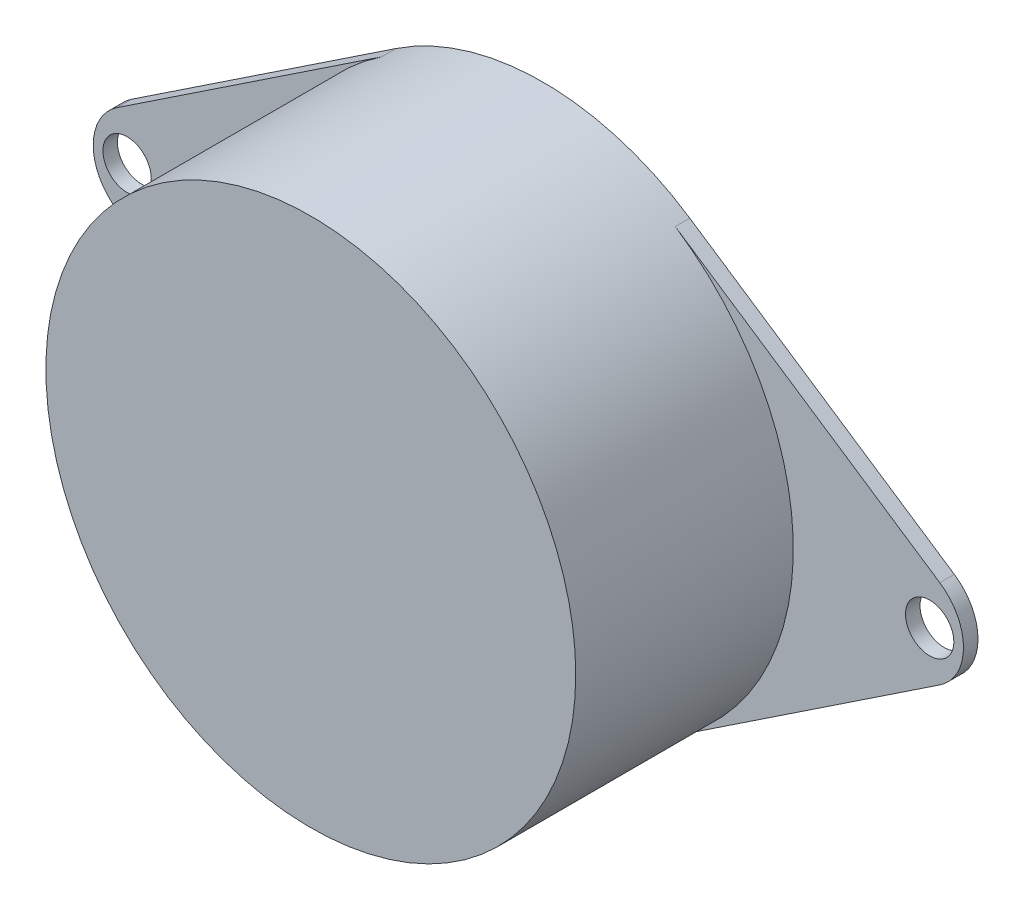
ISO-10303-21;
HEADER;
FILE_DESCRIPTION(('STEP AP214'),'2;1');
FILE_NAME('part.step','',(''),(''),'','','');
FILE_SCHEMA(('AUTOMOTIVE_DESIGN { 1 0 10303 214 1 1 1 1 }'));
ENDSEC;
DATA;
#1=APPLICATION_CONTEXT('core data for automotive mechanical design processes');
#2=APPLICATION_PROTOCOL_DEFINITION('international standard','automotive_design',2000,#1);
#3=PRODUCT_CONTEXT('',#1,'mechanical');
#4=PRODUCT('Part','Part','',(#3));
#5=PRODUCT_RELATED_PRODUCT_CATEGORY('part','',(#4));
#6=PRODUCT_DEFINITION_FORMATION('','',#4);
#7=PRODUCT_DEFINITION_CONTEXT('part definition',#1,'design');
#8=PRODUCT_DEFINITION('design','',#6,#7);
#9=PRODUCT_DEFINITION_SHAPE('','',#8);
#10=(LENGTH_UNIT() NAMED_UNIT(*) SI_UNIT(.MILLI.,.METRE.));
#11=(NAMED_UNIT(*) PLANE_ANGLE_UNIT() SI_UNIT($,.RADIAN.));
#12=(NAMED_UNIT(*) SI_UNIT($,.STERADIAN.) SOLID_ANGLE_UNIT());
#13=UNCERTAINTY_MEASURE_WITH_UNIT(LENGTH_MEASURE(1.E-05),#10,'distance_accuracy_value','');
#14=(GEOMETRIC_REPRESENTATION_CONTEXT(3) GLOBAL_UNCERTAINTY_ASSIGNED_CONTEXT((#13)) GLOBAL_UNIT_ASSIGNED_CONTEXT((#10,
#11,#12)) REPRESENTATION_CONTEXT('',''));
#15=CARTESIAN_POINT('',(0.,0.,0.));
#16=DIRECTION('',(0.,0.,1.));
#17=DIRECTION('',(1.,0.,0.));
#18=AXIS2_PLACEMENT_3D('',#15,#16,#17);
#19=CARTESIAN_POINT('',(0.,0.,0.));
#20=DIRECTION('',(0.,0.,1.));
#21=DIRECTION('',(1.,0.,0.));
#22=AXIS2_PLACEMENT_3D('',#19,#20,#21);
#23=PLANE('',#22);
#24=CARTESIAN_POINT('',(-41.5,0.,0.));
#25=DIRECTION('',(0.,0.,1.));
#26=DIRECTION('',(1.,0.,0.));
#27=AXIS2_PLACEMENT_3D('',#24,#25,#26);
#28=CIRCLE('',#27,2.5);
#29=CARTESIAN_POINT('',(-39.,0.,0.));
#30=VERTEX_POINT('',#29);
#31=EDGE_CURVE('E160',#30,#30,#28,.T.);
#32=ORIENTED_EDGE('',*,*,#31,.T.);
#33=EDGE_LOOP('',(#32));
#34=FACE_BOUND('',#33,.T.);
#35=CARTESIAN_POINT('',(41.5,0.,0.));
#36=DIRECTION('',(0.,0.,1.));
#37=DIRECTION('',(1.,0.,0.));
#38=AXIS2_PLACEMENT_3D('',#35,#36,#37);
#39=CIRCLE('',#38,2.5);
#40=CARTESIAN_POINT('',(44.,0.,0.));
#41=VERTEX_POINT('',#40);
#42=EDGE_CURVE('E156',#41,#41,#39,.T.);
#43=ORIENTED_EDGE('',*,*,#42,.T.);
#44=EDGE_LOOP('',(#43));
#45=FACE_BOUND('',#44,.T.);
#46=CARTESIAN_POINT('',(0.,0.,0.));
#47=DIRECTION('',(0.,0.,1.));
#48=DIRECTION('',(1.,0.,0.));
#49=AXIS2_PLACEMENT_3D('',#46,#47,#48);
#50=CIRCLE('',#49,27.4);
#51=CARTESIAN_POINT('',(15.1913924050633,22.8031049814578,0.));
#52=VERTEX_POINT('',#51);
#53=CARTESIAN_POINT('',(-15.1913924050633,22.8031049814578,0.));
#54=VERTEX_POINT('',#53);
#55=EDGE_CURVE('E179',#52,#54,#50,.T.);
#56=ORIENTED_EDGE('',*,*,#55,.F.);
#57=DIRECTION('',(-0.832230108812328,0.554430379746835,0.));
#58=VECTOR('',#57,1.);
#59=CARTESIAN_POINT('',(15.1913924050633,22.8031049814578,0.));
#60=LINE('',#59,#58);
#61=CARTESIAN_POINT('',(42.5493670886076,4.5772655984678,0.));
#62=VERTEX_POINT('',#61);
#63=EDGE_CURVE('E103',#62,#52,#60,.T.);
#64=ORIENTED_EDGE('',*,*,#63,.F.);
#65=CARTESIAN_POINT('',(39.5,0.,0.));
#66=DIRECTION('',(0.,0.,1.));
#67=DIRECTION('',(1.,0.,0.));
#68=AXIS2_PLACEMENT_3D('',#65,#66,#67);
#69=CIRCLE('',#68,5.5);
#70=CARTESIAN_POINT('',(42.5493670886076,-4.57726559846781,0.));
#71=VERTEX_POINT('',#70);
#72=EDGE_CURVE('E191',#71,#62,#69,.T.);
#73=ORIENTED_EDGE('',*,*,#72,.F.);
#74=DIRECTION('',(0.832230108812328,0.554430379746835,0.));
#75=VECTOR('',#74,1.);
#76=CARTESIAN_POINT('',(15.1913924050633,-22.8031049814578,0.));
#77=LINE('',#76,#75);
#78=CARTESIAN_POINT('',(15.1913924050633,-22.8031049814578,0.));
#79=VERTEX_POINT('',#78);
#80=EDGE_CURVE('E189',#79,#71,#77,.T.);
#81=ORIENTED_EDGE('',*,*,#80,.F.);
#82=CARTESIAN_POINT('',(0.,0.,0.));
#83=DIRECTION('',(0.,0.,1.));
#84=DIRECTION('',(1.,0.,0.));
#85=AXIS2_PLACEMENT_3D('',#82,#83,#84);
#86=CIRCLE('',#85,27.4);
#87=CARTESIAN_POINT('',(-15.1913924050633,-22.8031049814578,0.));
#88=VERTEX_POINT('',#87);
#89=EDGE_CURVE('E187',#88,#79,#86,.T.);
#90=ORIENTED_EDGE('',*,*,#89,.F.);
#91=DIRECTION('',(0.832230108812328,-0.554430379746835,0.));
#92=VECTOR('',#91,1.);
#93=CARTESIAN_POINT('',(-42.5493670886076,-4.57726559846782,0.));
#94=LINE('',#93,#92);
#95=CARTESIAN_POINT('',(-42.5493670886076,-4.57726559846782,0.));
#96=VERTEX_POINT('',#95);
#97=EDGE_CURVE('E185',#96,#88,#94,.T.);
#98=ORIENTED_EDGE('',*,*,#97,.F.);
#99=CARTESIAN_POINT('',(-39.5,0.,0.));
#100=DIRECTION('',(0.,0.,1.));
#101=DIRECTION('',(1.,0.,0.));
#102=AXIS2_PLACEMENT_3D('',#99,#100,#101);
#103=CIRCLE('',#102,5.5);
#104=CARTESIAN_POINT('',(-42.5493670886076,4.5772655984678,0.));
#105=VERTEX_POINT('',#104);
#106=EDGE_CURVE('E183',#105,#96,#103,.T.);
#107=ORIENTED_EDGE('',*,*,#106,.F.);
#108=DIRECTION('',(-0.832230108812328,-0.554430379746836,0.));
#109=VECTOR('',#108,1.);
#110=CARTESIAN_POINT('',(-42.5493670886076,4.57726559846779,0.));
#111=LINE('',#110,#109);
#112=EDGE_CURVE('E181',#54,#105,#111,.T.);
#113=ORIENTED_EDGE('',*,*,#112,.F.);
#114=EDGE_LOOP('',(#56,#64,#73,#81,#90,#98,#107,#113));
#115=FACE_BOUND('',#114,.T.);
#116=CARTESIAN_POINT('',(0.,0.,0.));
#117=DIRECTION('',(0.,0.,1.));
#118=DIRECTION('',(1.,0.,0.));
#119=AXIS2_PLACEMENT_3D('',#116,#117,#118);
#120=CIRCLE('',#119,5.4);
#121=CARTESIAN_POINT('',(5.4,0.,0.));
#122=VERTEX_POINT('',#121);
#123=EDGE_CURVE('E11',#122,#122,#120,.F.);
#124=ORIENTED_EDGE('',*,*,#123,.F.);
#125=EDGE_LOOP('',(#124));
#126=FACE_BOUND('',#125,.T.);
#127=ADVANCED_FACE('F33',(#34,#45,#115,#126),#23,.F.);
#128=CARTESIAN_POINT('',(0.,0.,1.5));
#129=DIRECTION('',(0.,0.,1.));
#130=DIRECTION('',(1.,0.,0.));
#131=AXIS2_PLACEMENT_3D('',#128,#129,#130);
#132=PLANE('',#131);
#133=CARTESIAN_POINT('',(-41.5,0.,1.5));
#134=DIRECTION('',(0.,0.,1.));
#135=DIRECTION('',(1.,0.,0.));
#136=AXIS2_PLACEMENT_3D('',#133,#134,#135);
#137=CIRCLE('',#136,2.5);
#138=CARTESIAN_POINT('',(-39.,0.,1.5));
#139=VERTEX_POINT('',#138);
#140=EDGE_CURVE('E162',#139,#139,#137,.T.);
#141=ORIENTED_EDGE('',*,*,#140,.F.);
#142=EDGE_LOOP('',(#141));
#143=FACE_BOUND('',#142,.T.);
#144=CARTESIAN_POINT('',(0.,0.,1.5));
#145=DIRECTION('',(0.,0.,1.));
#146=DIRECTION('',(1.,0.,0.));
#147=AXIS2_PLACEMENT_3D('',#144,#145,#146);
#148=CIRCLE('',#147,27.4);
#149=CARTESIAN_POINT('',(-15.1913924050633,22.8031049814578,1.5));
#150=VERTEX_POINT('',#149);
#151=CARTESIAN_POINT('',(-15.1913924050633,-22.8031049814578,1.5));
#152=VERTEX_POINT('',#151);
#153=EDGE_CURVE('E41',#150,#152,#148,.T.);
#154=ORIENTED_EDGE('',*,*,#153,.F.);
#155=DIRECTION('',(-0.832230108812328,-0.554430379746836,0.));
#156=VECTOR('',#155,1.);
#157=CARTESIAN_POINT('',(-42.5493670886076,4.57726559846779,1.5));
#158=LINE('',#157,#156);
#159=CARTESIAN_POINT('',(-42.5493670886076,4.5772655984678,1.5));
#160=VERTEX_POINT('',#159);
#161=EDGE_CURVE('E150',#150,#160,#158,.T.);
#162=ORIENTED_EDGE('',*,*,#161,.T.);
#163=CARTESIAN_POINT('',(-39.5,0.,1.5));
#164=DIRECTION('',(0.,0.,1.));
#165=DIRECTION('',(1.,0.,0.));
#166=AXIS2_PLACEMENT_3D('',#163,#164,#165);
#167=CIRCLE('',#166,5.5);
#168=CARTESIAN_POINT('',(-42.5493670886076,-4.57726559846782,1.5));
#169=VERTEX_POINT('',#168);
#170=EDGE_CURVE('E141',#160,#169,#167,.T.);
#171=ORIENTED_EDGE('',*,*,#170,.T.);
#172=DIRECTION('',(0.832230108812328,-0.554430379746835,0.));
#173=VECTOR('',#172,1.);
#174=CARTESIAN_POINT('',(-42.5493670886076,-4.57726559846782,1.5));
#175=LINE('',#174,#173);
#176=EDGE_CURVE('E139',#169,#152,#175,.T.);
#177=ORIENTED_EDGE('',*,*,#176,.T.);
#178=EDGE_LOOP('',(#154,#162,#171,#177));
#179=FACE_BOUND('',#178,.T.);
#180=ADVANCED_FACE('F220',(#143,#179),#132,.T.);
#181=CARTESIAN_POINT('',(-42.5493670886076,4.57726559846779,1.5));
#182=DIRECTION('',(0.554430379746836,-0.832230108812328,0.));
#183=DIRECTION('',(0.832230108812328,0.554430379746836,0.));
#184=AXIS2_PLACEMENT_3D('',#181,#182,#183);
#185=PLANE('',#184);
#186=ORIENTED_EDGE('',*,*,#112,.T.);
#187=DIRECTION('',(0.,0.,-1.));
#188=VECTOR('',#187,1.);
#189=CARTESIAN_POINT('',(-42.5493670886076,4.5772655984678,1.5));
#190=LINE('',#189,#188);
#191=EDGE_CURVE('E123',#160,#105,#190,.T.);
#192=ORIENTED_EDGE('',*,*,#191,.F.);
#193=ORIENTED_EDGE('',*,*,#161,.F.);
#194=DIRECTION('',(0.,0.,-1.));
#195=VECTOR('',#194,1.);
#196=CARTESIAN_POINT('',(-15.1913924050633,22.8031049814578,1.5));
#197=LINE('',#196,#195);
#198=EDGE_CURVE('E118',#150,#54,#197,.T.);
#199=ORIENTED_EDGE('',*,*,#198,.T.);
#200=EDGE_LOOP('',(#186,#192,#193,#199));
#201=FACE_BOUND('',#200,.T.);
#202=ADVANCED_FACE('F35',(#201),#185,.F.);
#203=CARTESIAN_POINT('',(-39.5,0.,1.5));
#204=DIRECTION('',(0.,0.,-1.));
#205=DIRECTION('',(-1.,0.,0.));
#206=AXIS2_PLACEMENT_3D('',#203,#204,#205);
#207=CYLINDRICAL_SURFACE('',#206,5.5);
#208=ORIENTED_EDGE('',*,*,#106,.T.);
#209=DIRECTION('',(0.,0.,-1.));
#210=VECTOR('',#209,1.);
#211=CARTESIAN_POINT('',(-42.5493670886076,-4.57726559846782,1.5));
#212=LINE('',#211,#210);
#213=EDGE_CURVE('E147',#169,#96,#212,.T.);
#214=ORIENTED_EDGE('',*,*,#213,.F.);
#215=ORIENTED_EDGE('',*,*,#170,.F.);
#216=ORIENTED_EDGE('',*,*,#191,.T.);
#217=EDGE_LOOP('',(#208,#214,#215,#216));
#218=FACE_BOUND('',#217,.T.);
#219=ADVANCED_FACE('F209',(#218),#207,.T.);
#220=CARTESIAN_POINT('',(-42.5493670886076,-4.57726559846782,1.5));
#221=DIRECTION('',(0.554430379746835,0.832230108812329,0.));
#222=DIRECTION('',(-0.832230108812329,0.554430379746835,0.));
#223=AXIS2_PLACEMENT_3D('',#220,#221,#222);
#224=PLANE('',#223);
#225=ORIENTED_EDGE('',*,*,#97,.T.);
#226=DIRECTION('',(0.,0.,-1.));
#227=VECTOR('',#226,1.);
#228=CARTESIAN_POINT('',(-15.1913924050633,-22.8031049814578,1.5));
#229=LINE('',#228,#227);
#230=EDGE_CURVE('E144',#152,#88,#229,.T.);
#231=ORIENTED_EDGE('',*,*,#230,.F.);
#232=ORIENTED_EDGE('',*,*,#176,.F.);
#233=ORIENTED_EDGE('',*,*,#213,.T.);
#234=EDGE_LOOP('',(#225,#231,#232,#233));
#235=FACE_BOUND('',#234,.T.);
#236=ADVANCED_FACE('F217',(#235),#224,.F.);
#237=CARTESIAN_POINT('',(0.,0.,1.5));
#238=DIRECTION('',(0.,0.,-1.));
#239=DIRECTION('',(-1.,0.,0.));
#240=AXIS2_PLACEMENT_3D('',#237,#238,#239);
#241=CYLINDRICAL_SURFACE('',#240,27.4);
#242=ORIENTED_EDGE('',*,*,#89,.T.);
#243=DIRECTION('',(0.,0.,-1.));
#244=VECTOR('',#243,1.);
#245=CARTESIAN_POINT('',(15.1913924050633,-22.8031049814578,1.5));
#246=LINE('',#245,#244);
#247=CARTESIAN_POINT('',(15.1913924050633,-22.8031049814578,1.5));
#248=VERTEX_POINT('',#247);
#249=EDGE_CURVE('E117',#248,#79,#246,.T.);
#250=ORIENTED_EDGE('',*,*,#249,.F.);
#251=CARTESIAN_POINT('',(15.1913924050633,22.8031049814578,1.5));
#252=VERTEX_POINT('',#251);
#253=EDGE_CURVE('E111',#248,#252,#148,.T.);
#254=ORIENTED_EDGE('',*,*,#253,.T.);
#255=DIRECTION('',(0.,0.,-1.));
#256=VECTOR('',#255,1.);
#257=CARTESIAN_POINT('',(15.1913924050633,22.8031049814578,1.5));
#258=LINE('',#257,#256);
#259=EDGE_CURVE('E98',#252,#52,#258,.T.);
#260=ORIENTED_EDGE('',*,*,#259,.T.);
#261=ORIENTED_EDGE('',*,*,#55,.T.);
#262=ORIENTED_EDGE('',*,*,#198,.F.);
#263=ORIENTED_EDGE('',*,*,#153,.T.);
#264=ORIENTED_EDGE('',*,*,#230,.T.);
#265=EDGE_LOOP('',(#242,#250,#254,#260,#261,#262,#263,#264));
#266=FACE_BOUND('',#265,.T.);
#267=CARTESIAN_POINT('',(0.,0.,24.));
#268=DIRECTION('',(0.,0.,1.));
#269=DIRECTION('',(1.,0.,0.));
#270=AXIS2_PLACEMENT_3D('',#267,#268,#269);
#271=CIRCLE('',#270,27.4);
#272=CARTESIAN_POINT('',(27.4,0.,24.));
#273=VERTEX_POINT('',#272);
#274=EDGE_CURVE('E158',#273,#273,#271,.T.);
#275=ORIENTED_EDGE('',*,*,#274,.F.);
#276=EDGE_LOOP('',(#275));
#277=FACE_BOUND('',#276,.T.);
#278=ADVANCED_FACE('F114',(#266,#277),#241,.T.);
#279=CARTESIAN_POINT('',(15.1913924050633,-22.8031049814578,1.5));
#280=DIRECTION('',(-0.554430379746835,0.832230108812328,0.));
#281=DIRECTION('',(-0.832230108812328,-0.554430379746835,0.));
#282=AXIS2_PLACEMENT_3D('',#279,#280,#281);
#283=PLANE('',#282);
#284=ORIENTED_EDGE('',*,*,#80,.T.);
#285=DIRECTION('',(0.,0.,-1.));
#286=VECTOR('',#285,1.);
#287=CARTESIAN_POINT('',(42.5493670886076,-4.57726559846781,1.5));
#288=LINE('',#287,#286);
#289=CARTESIAN_POINT('',(42.5493670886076,-4.57726559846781,1.5));
#290=VERTEX_POINT('',#289);
#291=EDGE_CURVE('E197',#290,#71,#288,.T.);
#292=ORIENTED_EDGE('',*,*,#291,.F.);
#293=DIRECTION('',(0.832230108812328,0.554430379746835,0.));
#294=VECTOR('',#293,1.);
#295=CARTESIAN_POINT('',(15.1913924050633,-22.8031049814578,1.5));
#296=LINE('',#295,#294);
#297=EDGE_CURVE('E53',#248,#290,#296,.T.);
#298=ORIENTED_EDGE('',*,*,#297,.F.);
#299=ORIENTED_EDGE('',*,*,#249,.T.);
#300=EDGE_LOOP('',(#284,#292,#298,#299));
#301=FACE_BOUND('',#300,.T.);
#302=ADVANCED_FACE('F225',(#301),#283,.F.);
#303=CARTESIAN_POINT('',(39.5,0.,1.5));
#304=DIRECTION('',(0.,0.,-1.));
#305=DIRECTION('',(-1.,0.,0.));
#306=AXIS2_PLACEMENT_3D('',#303,#304,#305);
#307=CYLINDRICAL_SURFACE('',#306,5.5);
#308=ORIENTED_EDGE('',*,*,#72,.T.);
#309=DIRECTION('',(0.,0.,-1.));
#310=VECTOR('',#309,1.);
#311=CARTESIAN_POINT('',(42.5493670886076,4.5772655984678,1.5));
#312=LINE('',#311,#310);
#313=CARTESIAN_POINT('',(42.5493670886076,4.5772655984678,1.5));
#314=VERTEX_POINT('',#313);
#315=EDGE_CURVE('E108',#314,#62,#312,.T.);
#316=ORIENTED_EDGE('',*,*,#315,.F.);
#317=CARTESIAN_POINT('',(39.5,0.,1.5));
#318=DIRECTION('',(0.,0.,1.));
#319=DIRECTION('',(1.,0.,0.));
#320=AXIS2_PLACEMENT_3D('',#317,#318,#319);
#321=CIRCLE('',#320,5.5);
#322=EDGE_CURVE('E48',#290,#314,#321,.T.);
#323=ORIENTED_EDGE('',*,*,#322,.F.);
#324=ORIENTED_EDGE('',*,*,#291,.T.);
#325=EDGE_LOOP('',(#308,#316,#323,#324));
#326=FACE_BOUND('',#325,.T.);
#327=ADVANCED_FACE('F223',(#326),#307,.T.);
#328=CARTESIAN_POINT('',(15.1913924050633,22.8031049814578,1.5));
#329=DIRECTION('',(-0.554430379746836,-0.832230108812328,0.));
#330=DIRECTION('',(0.832230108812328,-0.554430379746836,0.));
#331=AXIS2_PLACEMENT_3D('',#328,#329,#330);
#332=PLANE('',#331);
#333=ORIENTED_EDGE('',*,*,#63,.T.);
#334=ORIENTED_EDGE('',*,*,#259,.F.);
#335=DIRECTION('',(-0.832230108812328,0.554430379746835,0.));
#336=VECTOR('',#335,1.);
#337=CARTESIAN_POINT('',(15.1913924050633,22.8031049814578,1.5));
#338=LINE('',#337,#336);
#339=EDGE_CURVE('E101',#314,#252,#338,.T.);
#340=ORIENTED_EDGE('',*,*,#339,.F.);
#341=ORIENTED_EDGE('',*,*,#315,.T.);
#342=EDGE_LOOP('',(#333,#334,#340,#341));
#343=FACE_BOUND('',#342,.T.);
#344=ADVANCED_FACE('F99',(#343),#332,.F.);
#345=CARTESIAN_POINT('',(41.5,0.,1.5));
#346=DIRECTION('',(0.,0.,1.));
#347=DIRECTION('',(1.,0.,0.));
#348=AXIS2_PLACEMENT_3D('',#345,#346,#347);
#349=CIRCLE('',#348,2.5);
#350=CARTESIAN_POINT('',(44.,0.,1.5));
#351=VERTEX_POINT('',#350);
#352=EDGE_CURVE('E159',#351,#351,#349,.T.);
#353=ORIENTED_EDGE('',*,*,#352,.F.);
#354=EDGE_LOOP('',(#353));
#355=FACE_BOUND('',#354,.T.);
#356=ORIENTED_EDGE('',*,*,#253,.F.);
#357=ORIENTED_EDGE('',*,*,#297,.T.);
#358=ORIENTED_EDGE('',*,*,#322,.T.);
#359=ORIENTED_EDGE('',*,*,#339,.T.);
#360=EDGE_LOOP('',(#356,#357,#358,#359));
#361=FACE_BOUND('',#360,.T.);
#362=ADVANCED_FACE('F110',(#355,#361),#132,.T.);
#363=CARTESIAN_POINT('',(0.,0.,24.));
#364=DIRECTION('',(0.,0.,1.));
#365=DIRECTION('',(1.,0.,0.));
#366=AXIS2_PLACEMENT_3D('',#363,#364,#365);
#367=PLANE('',#366);
#368=ORIENTED_EDGE('',*,*,#274,.T.);
#369=EDGE_LOOP('',(#368));
#370=FACE_BOUND('',#369,.T.);
#371=ADVANCED_FACE('F277',(#370),#367,.T.);
#372=CARTESIAN_POINT('',(41.5,0.,-21.));
#373=DIRECTION('',(0.,0.,1.));
#374=DIRECTION('',(1.,0.,0.));
#375=AXIS2_PLACEMENT_3D('',#372,#373,#374);
#376=CYLINDRICAL_SURFACE('',#375,2.5);
#377=CARTESIAN_POINT('',(44.,0.,1.5));
#378=CARTESIAN_POINT('',(44.,0.,1.484375));
#379=CARTESIAN_POINT('',(44.,0.,1.46875));
#380=CARTESIAN_POINT('',(44.,0.,1.4375));
#381=CARTESIAN_POINT('',(44.,0.,1.421875));
#382=CARTESIAN_POINT('',(44.,0.,1.390625));
#383=CARTESIAN_POINT('',(44.,0.,1.375));
#384=CARTESIAN_POINT('',(44.,0.,1.34375));
#385=CARTESIAN_POINT('',(44.,0.,1.328125));
#386=CARTESIAN_POINT('',(44.,0.,1.296875));
#387=CARTESIAN_POINT('',(44.,0.,1.28125));
#388=CARTESIAN_POINT('',(44.,0.,1.25));
#389=CARTESIAN_POINT('',(44.,0.,1.234375));
#390=CARTESIAN_POINT('',(44.,0.,1.203125));
#391=CARTESIAN_POINT('',(44.,0.,1.1875));
#392=CARTESIAN_POINT('',(44.,0.,1.15625));
#393=CARTESIAN_POINT('',(44.,0.,1.140625));
#394=CARTESIAN_POINT('',(44.,0.,1.109375));
#395=CARTESIAN_POINT('',(44.,0.,1.09375));
#396=CARTESIAN_POINT('',(44.,0.,1.0625));
#397=CARTESIAN_POINT('',(44.,0.,1.046875));
#398=CARTESIAN_POINT('',(44.,0.,1.015625));
#399=CARTESIAN_POINT('',(44.,0.,0.999999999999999));
#400=CARTESIAN_POINT('',(44.,0.,0.968749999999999));
#401=CARTESIAN_POINT('',(44.,0.,0.953124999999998));
#402=CARTESIAN_POINT('',(44.,0.,0.921874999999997));
#403=CARTESIAN_POINT('',(44.,0.,0.906249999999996));
#404=CARTESIAN_POINT('',(44.,0.,0.874999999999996));
#405=CARTESIAN_POINT('',(44.,0.,0.859374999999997));
#406=CARTESIAN_POINT('',(44.,0.,0.828124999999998));
#407=CARTESIAN_POINT('',(44.,0.,0.812499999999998));
#408=CARTESIAN_POINT('',(44.,0.,0.781249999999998));
#409=CARTESIAN_POINT('',(44.,0.,0.765624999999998));
#410=CARTESIAN_POINT('',(44.,0.,0.734374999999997));
#411=CARTESIAN_POINT('',(44.,0.,0.718749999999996));
#412=CARTESIAN_POINT('',(44.,0.,0.687499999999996));
#413=CARTESIAN_POINT('',(44.,0.,0.671874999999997));
#414=CARTESIAN_POINT('',(44.,0.,0.640624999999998));
#415=CARTESIAN_POINT('',(44.,0.,0.624999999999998));
#416=CARTESIAN_POINT('',(44.,0.,0.593749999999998));
#417=CARTESIAN_POINT('',(44.,0.,0.578124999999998));
#418=CARTESIAN_POINT('',(44.,0.,0.546874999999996));
#419=CARTESIAN_POINT('',(44.,0.,0.531249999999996));
#420=CARTESIAN_POINT('',(44.,0.,0.499999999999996));
#421=CARTESIAN_POINT('',(44.,0.,0.484374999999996));
#422=CARTESIAN_POINT('',(44.,0.,0.453124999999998));
#423=CARTESIAN_POINT('',(44.,0.,0.437499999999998));
#424=CARTESIAN_POINT('',(44.,0.,0.406249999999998));
#425=CARTESIAN_POINT('',(44.,0.,0.390624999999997));
#426=CARTESIAN_POINT('',(44.,0.,0.359374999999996));
#427=CARTESIAN_POINT('',(44.,0.,0.343749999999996));
#428=CARTESIAN_POINT('',(44.,0.,0.312499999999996));
#429=CARTESIAN_POINT('',(44.,0.,0.296874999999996));
#430=CARTESIAN_POINT('',(44.,0.,0.265624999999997));
#431=CARTESIAN_POINT('',(44.,0.,0.249999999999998));
#432=CARTESIAN_POINT('',(44.,0.,0.218749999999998));
#433=CARTESIAN_POINT('',(44.,0.,0.203124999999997));
#434=CARTESIAN_POINT('',(44.,0.,0.171874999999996));
#435=CARTESIAN_POINT('',(44.,0.,0.156249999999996));
#436=CARTESIAN_POINT('',(44.,0.,0.124999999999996));
#437=CARTESIAN_POINT('',(44.,0.,0.109374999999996));
#438=CARTESIAN_POINT('',(44.,0.,0.0781249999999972));
#439=CARTESIAN_POINT('',(44.,0.,0.0624999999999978));
#440=CARTESIAN_POINT('',(44.,0.,0.0312499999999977));
#441=CARTESIAN_POINT('',(44.,0.,0.0156249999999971));
#442=CARTESIAN_POINT('',(44.,0.,0.));
#443=B_SPLINE_CURVE_WITH_KNOTS('',3,(#377,#378,#379,#380,#381,#382,#383,#384,#385,#386,#387,
#388,#389,#390,#391,#392,#393,#394,#395,#396,#397,#398,#399,#400,#401,#402,#403,#404,#405,#406,
#407,#408,#409,#410,#411,#412,#413,#414,#415,#416,#417,#418,#419,#420,#421,#422,#423,#424,#425,
#426,#427,#428,#429,#430,#431,#432,#433,#434,#435,#436,#437,#438,#439,#440,#441,#442),
.UNSPECIFIED.,.F.,.F.,(4,2,2,2,2,2,2,2,2,2,2,2,2,2,2,2,2,2,2,2,2,2,2,2,2,2,2,2,2,2,2,2,4),(0.,
0.0468750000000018,0.0937500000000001,0.140624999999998,0.1875,0.234375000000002,0.28125,
0.328124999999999,0.375,0.421875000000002,0.46875,0.515624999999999,0.5625,0.609375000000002,
0.656250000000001,0.703124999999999,0.750000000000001,0.796875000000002,0.843750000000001,
0.890624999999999,0.937500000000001,0.984375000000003,1.03125,1.078125,1.125,1.171875,1.21875,
1.265625,1.3125,1.359375,1.40625,1.453125,1.5),.UNSPECIFIED.);
#444=EDGE_CURVE('BSEAM273',#351,#41,#443,.T.);
#445=ORIENTED_EDGE('',*,*,#352,.T.);
#446=ORIENTED_EDGE('',*,*,#42,.F.);
#447=ORIENTED_EDGE('',*,*,#444,.T.);
#448=ORIENTED_EDGE('',*,*,#444,.F.);
#449=EDGE_LOOP('',(#445,#447,#446,#448));
#450=FACE_BOUND('',#449,.T.);
#451=ADVANCED_FACE('F273',(#450),#376,.F.);
#452=CARTESIAN_POINT('',(-41.5,0.,-21.));
#453=DIRECTION('',(0.,0.,1.));
#454=DIRECTION('',(1.,0.,0.));
#455=AXIS2_PLACEMENT_3D('',#452,#453,#454);
#456=CYLINDRICAL_SURFACE('',#455,2.5);
#457=CARTESIAN_POINT('',(-39.,0.,1.5));
#458=CARTESIAN_POINT('',(-39.,0.,1.484375));
#459=CARTESIAN_POINT('',(-39.,0.,1.46875));
#460=CARTESIAN_POINT('',(-39.,0.,1.4375));
#461=CARTESIAN_POINT('',(-39.,0.,1.421875));
#462=CARTESIAN_POINT('',(-39.,0.,1.390625));
#463=CARTESIAN_POINT('',(-39.,0.,1.375));
#464=CARTESIAN_POINT('',(-39.,0.,1.34375));
#465=CARTESIAN_POINT('',(-39.,0.,1.328125));
#466=CARTESIAN_POINT('',(-39.,0.,1.296875));
#467=CARTESIAN_POINT('',(-39.,0.,1.28125));
#468=CARTESIAN_POINT('',(-39.,0.,1.25));
#469=CARTESIAN_POINT('',(-39.,0.,1.234375));
#470=CARTESIAN_POINT('',(-39.,0.,1.203125));
#471=CARTESIAN_POINT('',(-39.,0.,1.1875));
#472=CARTESIAN_POINT('',(-39.,0.,1.15625));
#473=CARTESIAN_POINT('',(-39.,0.,1.140625));
#474=CARTESIAN_POINT('',(-39.,0.,1.109375));
#475=CARTESIAN_POINT('',(-39.,0.,1.09375));
#476=CARTESIAN_POINT('',(-39.,0.,1.0625));
#477=CARTESIAN_POINT('',(-39.,0.,1.046875));
#478=CARTESIAN_POINT('',(-39.,0.,1.015625));
#479=CARTESIAN_POINT('',(-39.,0.,0.999999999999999));
#480=CARTESIAN_POINT('',(-39.,0.,0.968749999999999));
#481=CARTESIAN_POINT('',(-39.,0.,0.953124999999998));
#482=CARTESIAN_POINT('',(-39.,0.,0.921874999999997));
#483=CARTESIAN_POINT('',(-39.,0.,0.906249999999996));
#484=CARTESIAN_POINT('',(-39.,0.,0.874999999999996));
#485=CARTESIAN_POINT('',(-39.,0.,0.859374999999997));
#486=CARTESIAN_POINT('',(-39.,0.,0.828124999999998));
#487=CARTESIAN_POINT('',(-39.,0.,0.812499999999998));
#488=CARTESIAN_POINT('',(-39.,0.,0.781249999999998));
#489=CARTESIAN_POINT('',(-39.,0.,0.765624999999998));
#490=CARTESIAN_POINT('',(-39.,0.,0.734374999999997));
#491=CARTESIAN_POINT('',(-39.,0.,0.718749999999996));
#492=CARTESIAN_POINT('',(-39.,0.,0.687499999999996));
#493=CARTESIAN_POINT('',(-39.,0.,0.671874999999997));
#494=CARTESIAN_POINT('',(-39.,0.,0.640624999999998));
#495=CARTESIAN_POINT('',(-39.,0.,0.624999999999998));
#496=CARTESIAN_POINT('',(-39.,0.,0.593749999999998));
#497=CARTESIAN_POINT('',(-39.,0.,0.578124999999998));
#498=CARTESIAN_POINT('',(-39.,0.,0.546874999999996));
#499=CARTESIAN_POINT('',(-39.,0.,0.531249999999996));
#500=CARTESIAN_POINT('',(-39.,0.,0.499999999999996));
#501=CARTESIAN_POINT('',(-39.,0.,0.484374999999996));
#502=CARTESIAN_POINT('',(-39.,0.,0.453124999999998));
#503=CARTESIAN_POINT('',(-39.,0.,0.437499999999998));
#504=CARTESIAN_POINT('',(-39.,0.,0.406249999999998));
#505=CARTESIAN_POINT('',(-39.,0.,0.390624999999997));
#506=CARTESIAN_POINT('',(-39.,0.,0.359374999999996));
#507=CARTESIAN_POINT('',(-39.,0.,0.343749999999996));
#508=CARTESIAN_POINT('',(-39.,0.,0.312499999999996));
#509=CARTESIAN_POINT('',(-39.,0.,0.296874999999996));
#510=CARTESIAN_POINT('',(-39.,0.,0.265624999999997));
#511=CARTESIAN_POINT('',(-39.,0.,0.249999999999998));
#512=CARTESIAN_POINT('',(-39.,0.,0.218749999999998));
#513=CARTESIAN_POINT('',(-39.,0.,0.203124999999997));
#514=CARTESIAN_POINT('',(-39.,0.,0.171874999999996));
#515=CARTESIAN_POINT('',(-39.,0.,0.156249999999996));
#516=CARTESIAN_POINT('',(-39.,0.,0.124999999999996));
#517=CARTESIAN_POINT('',(-39.,0.,0.109374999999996));
#518=CARTESIAN_POINT('',(-39.,0.,0.0781249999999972));
#519=CARTESIAN_POINT('',(-39.,0.,0.0624999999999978));
#520=CARTESIAN_POINT('',(-39.,0.,0.0312499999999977));
#521=CARTESIAN_POINT('',(-39.,0.,0.0156249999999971));
#522=CARTESIAN_POINT('',(-39.,0.,0.));
#523=B_SPLINE_CURVE_WITH_KNOTS('',3,(#457,#458,#459,#460,#461,#462,#463,#464,#465,#466,#467,
#468,#469,#470,#471,#472,#473,#474,#475,#476,#477,#478,#479,#480,#481,#482,#483,#484,#485,#486,
#487,#488,#489,#490,#491,#492,#493,#494,#495,#496,#497,#498,#499,#500,#501,#502,#503,#504,#505,
#506,#507,#508,#509,#510,#511,#512,#513,#514,#515,#516,#517,#518,#519,#520,#521,#522),
.UNSPECIFIED.,.F.,.F.,(4,2,2,2,2,2,2,2,2,2,2,2,2,2,2,2,2,2,2,2,2,2,2,2,2,2,2,2,2,2,2,2,4),(0.,
0.0468750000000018,0.0937500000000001,0.140624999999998,0.1875,0.234375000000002,0.28125,
0.328124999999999,0.375,0.421875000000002,0.46875,0.515624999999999,0.5625,0.609375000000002,
0.656250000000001,0.703124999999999,0.750000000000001,0.796875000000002,0.843750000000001,
0.890624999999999,0.937500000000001,0.984375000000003,1.03125,1.078125,1.125,1.171875,1.21875,
1.265625,1.3125,1.359375,1.40625,1.453125,1.5),.UNSPECIFIED.);
#524=EDGE_CURVE('BSEAM264',#139,#30,#523,.T.);
#525=ORIENTED_EDGE('',*,*,#140,.T.);
#526=ORIENTED_EDGE('',*,*,#31,.F.);
#527=ORIENTED_EDGE('',*,*,#524,.T.);
#528=ORIENTED_EDGE('',*,*,#524,.F.);
#529=EDGE_LOOP('',(#525,#527,#526,#528));
#530=FACE_BOUND('',#529,.T.);
#531=ADVANCED_FACE('F264',(#530),#456,.F.);
#532=CARTESIAN_POINT('',(0.,0.,-2.));
#533=DIRECTION('',(0.,0.,-1.));
#534=DIRECTION('',(-1.,0.,0.));
#535=AXIS2_PLACEMENT_3D('',#532,#533,#534);
#536=PLANE('',#535);
#537=CARTESIAN_POINT('',(0.,0.,-2.));
#538=DIRECTION('',(0.,0.,-1.));
#539=DIRECTION('',(-1.,0.,0.));
#540=AXIS2_PLACEMENT_3D('',#537,#538,#539);
#541=CIRCLE('',#540,5.4);
#542=CARTESIAN_POINT('',(-5.4,0.,-2.));
#543=VERTEX_POINT('',#542);
#544=EDGE_CURVE('E168',#543,#543,#541,.T.);
#545=ORIENTED_EDGE('',*,*,#544,.T.);
#546=EDGE_LOOP('',(#545));
#547=FACE_BOUND('',#546,.T.);
#548=CARTESIAN_POINT('',(0.,0.,-2.));
#549=DIRECTION('',(0.,0.,-1.));
#550=DIRECTION('',(-1.,0.,0.));
#551=AXIS2_PLACEMENT_3D('',#548,#549,#550);
#552=CIRCLE('',#551,3.25);
#553=CARTESIAN_POINT('',(-3.25,0.,-2.));
#554=VERTEX_POINT('',#553);
#555=EDGE_CURVE('E173',#554,#554,#552,.T.);
#556=ORIENTED_EDGE('',*,*,#555,.F.);
#557=EDGE_LOOP('',(#556));
#558=FACE_BOUND('',#557,.T.);
#559=ADVANCED_FACE('F262',(#547,#558),#536,.T.);
#560=CARTESIAN_POINT('',(0.,0.,-2.));
#561=DIRECTION('',(0.,0.,1.));
#562=DIRECTION('',(1.,0.,0.));
#563=AXIS2_PLACEMENT_3D('',#560,#561,#562);
#564=CYLINDRICAL_SURFACE('',#563,5.4);
#565=ORIENTED_EDGE('',*,*,#544,.F.);
#566=EDGE_LOOP('',(#565));
#567=FACE_BOUND('',#566,.T.);
#568=ORIENTED_EDGE('',*,*,#123,.T.);
#569=EDGE_LOOP('',(#568));
#570=FACE_BOUND('',#569,.T.);
#571=ADVANCED_FACE('F251',(#567,#570),#564,.T.);
#572=CARTESIAN_POINT('',(0.,0.,-2.));
#573=DIRECTION('',(0.,0.,1.));
#574=DIRECTION('',(1.,0.,0.));
#575=AXIS2_PLACEMENT_3D('',#572,#573,#574);
#576=CYLINDRICAL_SURFACE('',#575,3.25);
#577=ORIENTED_EDGE('',*,*,#555,.T.);
#578=EDGE_LOOP('',(#577));
#579=FACE_BOUND('',#578,.T.);
#580=CARTESIAN_POINT('',(0.,0.,0.));
#581=DIRECTION('',(0.,0.,-1.));
#582=DIRECTION('',(-1.,0.,0.));
#583=AXIS2_PLACEMENT_3D('',#580,#581,#582);
#584=CIRCLE('',#583,3.25);
#585=CARTESIAN_POINT('',(-3.25,0.,0.));
#586=VERTEX_POINT('',#585);
#587=EDGE_CURVE('E256',#586,#586,#584,.T.);
#588=ORIENTED_EDGE('',*,*,#587,.F.);
#589=EDGE_LOOP('',(#588));
#590=FACE_BOUND('',#589,.T.);
#591=ADVANCED_FACE('F246',(#579,#590),#576,.F.);
#592=ORIENTED_EDGE('',*,*,#587,.T.);
#593=EDGE_LOOP('',(#592));
#594=FACE_BOUND('',#593,.T.);
#595=ADVANCED_FACE('F237',(#594),#23,.F.);
#596=CLOSED_SHELL('',(#127,#180,#202,#219,#236,#278,#302,#327,#344,#362,#371,#451,#531,#559,
#571,#591,#595));
#597=MANIFOLD_SOLID_BREP('B2',#596);
#598=ADVANCED_BREP_SHAPE_REPRESENTATION('',(#18,#597),#14);
#599=SHAPE_DEFINITION_REPRESENTATION(#9,#598);
ENDSEC;
END-ISO-10303-21;
